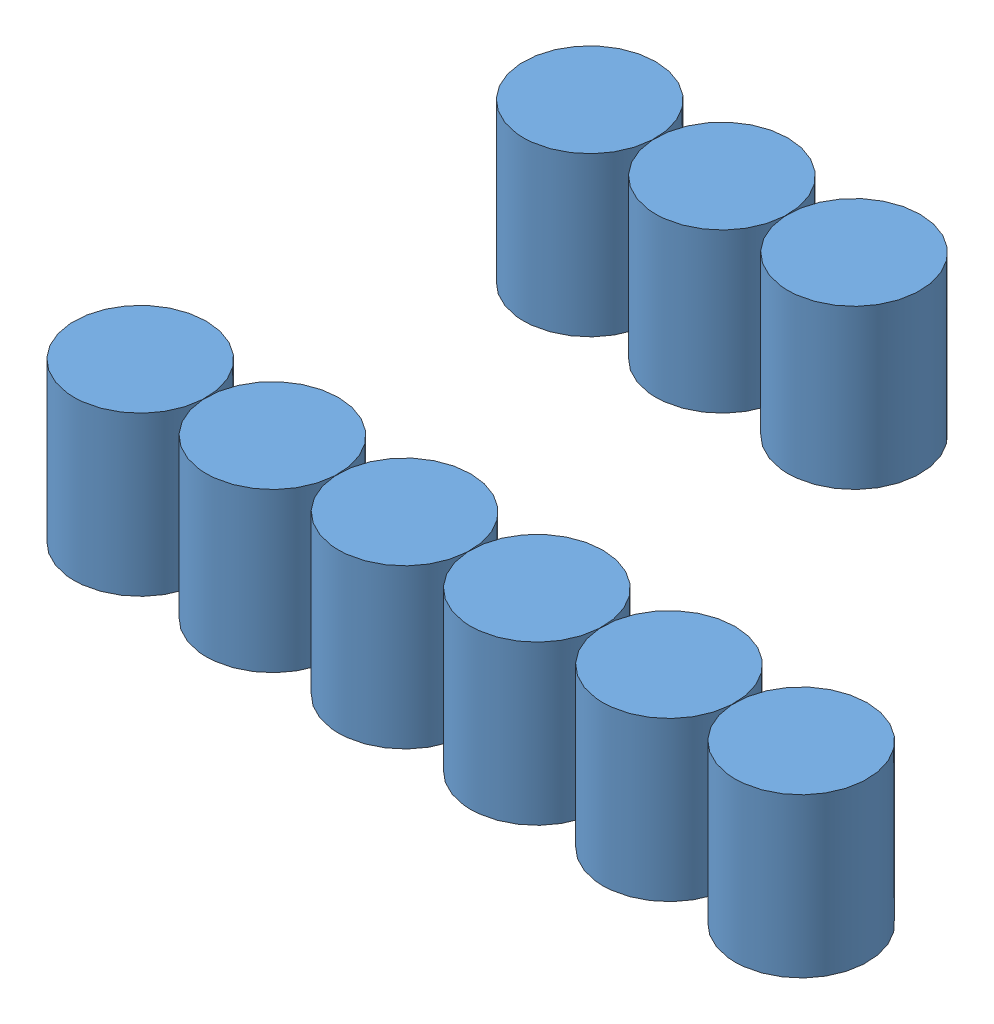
SolidWorks assembly 7061 GROUPAGE 1X3 Ø100.SLDASM, configuration Défaut (file format 8000). Lengths in mm.
Overall size (600 120 440).
9 component instances, 1 part files, 0 mates.
Components (placement in the parent):
- 1227 (120)-10: 1227 (120).SLDPRT [Défaut] at origin size (100 120 100)
- 1227 (120)-11: 1227 (120).SLDPRT [Défaut] at (-100 0 0) size (100 120 100)
- 1227 (120)-14: 1227 (120).SLDPRT [Défaut] at (100 0 0) size (100 120 100)
- 1227 (120)-12: 1227 (120).SLDPRT [Défaut] at (-100 0 -340) size (100 120 100)
- 1227 (120)-17: 1227 (120).SLDPRT [Défaut] at (0 0 -340) size (100 120 100)
- 1227 (120)-15: 1227 (120).SLDPRT [Défaut] at (100 0 -340) size (100 120 100)
- 1227 (120)-13: 1227 (120).SLDPRT [Défaut] at (200 0 0) size (100 120 100)
- 1227 (120)-16: 1227 (120).SLDPRT [Défaut] at (400 0 0) size (100 120 100)
- 1227 (120)-18: 1227 (120).SLDPRT [Défaut] at (300 0 0) size (100 120 100)
